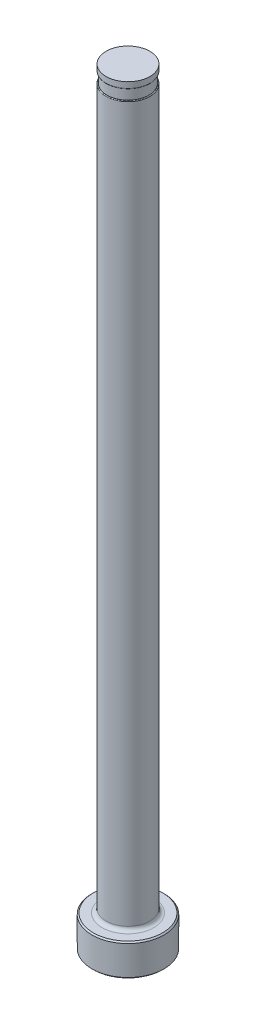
from build123d import *

# Parameters (mm, degrees)
CHAMFER1_SIZE     = 0.254
FILLET1_R         = 0.762
SKETCH2_W         = 0.2032
SKETCH2_H         = 2.032
D_SLOT_DEPTH      = 153.73390245
D_SLOT_DEPTH_BACK = 153.73390245
SKETCH5_W         = 0.0127
SKETCH5_H         = 1.27
FILLET2_R         = 0.127


with BuildPart() as part:
    # Sketch1 → Revolve1 (revolve)
    with BuildSketch(Plane.XY, mode=Mode.PRIVATE) as revolve1_sk:
        Polygon((0, 0), (-7.1374, 0), (-7.1374, 6.35), (-4.36499, 6.35), (-4.36499, 152.4), (0, 152.4), align=None)
    revolve(revolve1_sk.sketch.rotate(Axis((0, 259.958771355, 0), (0, -1, 0)), 270), axis=Axis((0, 259.958771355, 0), (0, -1, 0)))

    # Chamfer1
    chamfer1_edges = [part.edges().sort_by_distance(p)[0] for p in [
        (0, 6.35, -7.1374),
        (0, 0, -7.1374),
    ]]
    chamfer(chamfer1_edges, length=CHAMFER1_SIZE)

    # Fillet1
    fillet1_edges = [part.edges().sort_by_distance(p)[0] for p in [
        (0, 6.35, -4.36499),
    ]]
    fillet(fillet1_edges, radius=FILLET1_R)

    # Sketch2 → Vent Relief (revolve, cut)
    with BuildSketch(Plane.XY, mode=Mode.PRIVATE) as vent_relief_sk:
        with Locations((-4.26339, 150.114)):
            Rectangle(SKETCH2_W, SKETCH2_H)
    revolve(vent_relief_sk.sketch.rotate(Axis((0, 153.448281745, 0), (0, -1, 0)), 270), axis=Axis((0, 153.448281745, 0), (0, -1, 0)), mode=Mode.SUBTRACT)

    # Sketch3 → D-Slot (cut, two sides: drawn at the far end of the back side and taken through both)
    with BuildSketch(Plane.XY.offset(-D_SLOT_DEPTH_BACK)):
        with BuildLine():
            Line((-4.16179, 150.114), (-4.16179, 86.614))
            ThreePointArc((-4.16179, 86.614), (-4.213003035, 86.046038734), (-4.36499, 85.4964))
            Line((-4.36499, 85.4964), (-4.36499, 150.114))
            Line((-4.36499, 150.114), (-4.16179, 150.114))
        make_face()
    extrude(amount=D_SLOT_DEPTH + D_SLOT_DEPTH_BACK, mode=Mode.SUBTRACT)

    # Sketch5 → Vent Diameter (revolve, cut)
    with BuildSketch(Plane.XY, mode=Mode.PRIVATE) as vent_diameter_sk:
        with Locations((-4.35864, 151.765)):
            Rectangle(SKETCH5_W, SKETCH5_H)
    revolve(vent_diameter_sk.sketch.rotate(Axis((0, 152.687735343, 0), (0, -1, 0)), 90), axis=Axis((0, 152.687735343, 0), (0, -1, 0)), mode=Mode.SUBTRACT)

    # Fillet2
    fillet2_edges = [part.edges().sort_by_distance(p)[0] for p in [
        (3.521275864, 149.098, -2.579487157),
        (0, 151.13, 4.35229),
    ]]
    fillet(fillet2_edges, radius=FILLET2_R)


solid = part.part
